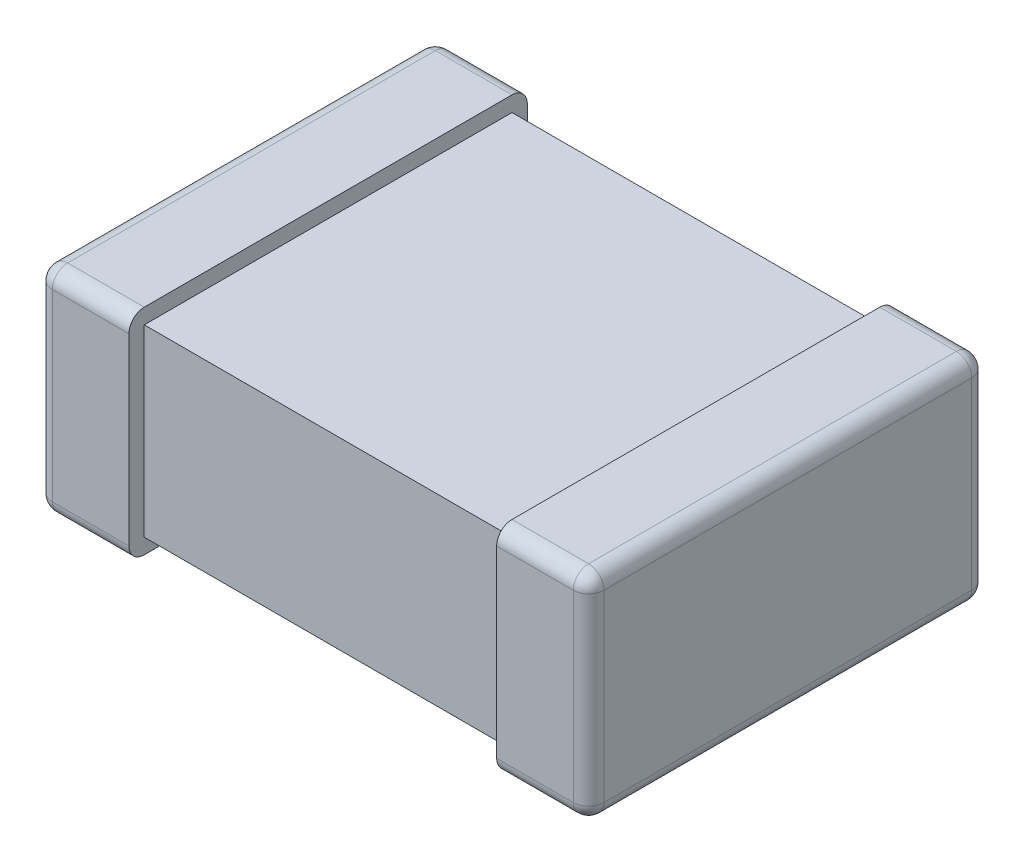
from build123d import *

# Parameters (mm, degrees)
SKETCH1_W           = 3.048
SKETCH1_H           = 3.048
BOSS_EXTRUDE1_DEPTH = 1.524
SKETCH3_W           = 3.302
SKETCH3_H           = 1.778
BOSS_EXTRUDE2_DEPTH = 0.762
SKETCH4_W           = 3.302
SKETCH4_H           = 1.778
BOSS_EXTRUDE3_DEPTH = 0.762
FILLET1_R           = 0.127


with BuildPart() as part:
    # Sketch1 → Boss-Extrude1 (new body)
    with BuildSketch(Plane(origin=(0, 0, 0), x_dir=(1, 0, 0), z_dir=(0, 1, 0))):
        Rectangle(SKETCH1_W, SKETCH1_H)
    extrude(amount=BOSS_EXTRUDE1_DEPTH)

    # Sketch3 → Boss-Extrude2 (add)
    with BuildSketch(Plane.ZY.offset(1.524)):
        with Locations((0, 0.762)):
            Rectangle(SKETCH3_W, SKETCH3_H)
    extrude(amount=BOSS_EXTRUDE2_DEPTH)

    # Sketch4 → Boss-Extrude3 (add)
    with BuildSketch(Plane(origin=(1.524, 0, 0), x_dir=(0, 0, -1), z_dir=(1, 0, 0))):
        with Locations((0, 0.762)):
            Rectangle(SKETCH4_W, SKETCH4_H)
    extrude(amount=BOSS_EXTRUDE3_DEPTH)

    # Fillet1
    fillet1_edges = [part.edges().sort_by_distance(p)[0] for p in [
        (-1.905, -0.127, 1.651),
        (-1.905, 1.651, 1.651),
        (-1.905, 1.651, -1.651),
        (-1.905, -0.127, -1.651),
        (-2.286, 0.762, 1.651),
        (-2.286, 1.651, 0),
        (-2.286, 0.762, -1.651),
        (-2.286, -0.127, 0),
        (1.905, -0.127, -1.651),
        (1.905, 1.651, -1.651),
        (1.905, 1.651, 1.651),
        (1.905, -0.127, 1.651),
        (2.286, 0.762, -1.651),
        (2.286, 1.651, 0),
        (2.286, 0.762, 1.651),
        (2.286, -0.127, 0),
    ]]
    fillet(fillet1_edges, radius=FILLET1_R)


solid = part.part
